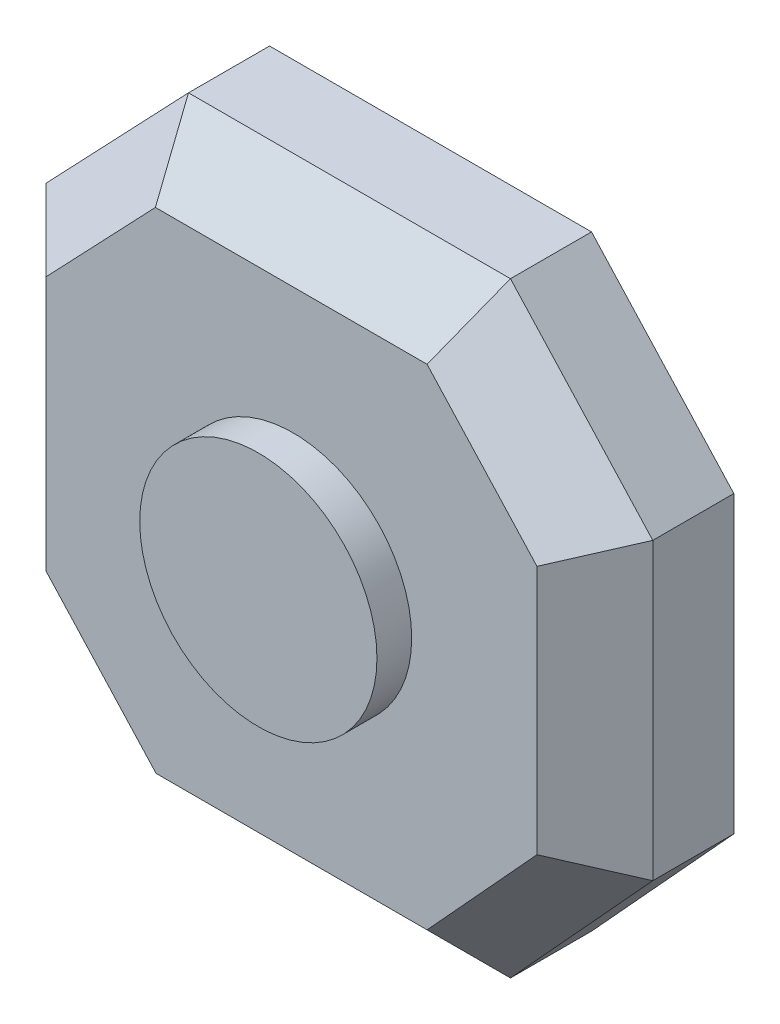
from build123d import *

# Parameters (mm, degrees)
AUFSATZ_LINEAR_AUSTRAGEN1_DEPTH = 1.2
FASE1_SIZE                      = 0.5
SKIZZE2_R                       = 1.024181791
AUFSATZ_LINEAR_AUSTRAGEN2_DEPTH = 1.5


with BuildPart() as part:
    # Skizze1 → Aufsatz-Linear austragen1 (new body)
    with BuildSketch(Plane.XY):
        Polygon((-1.403270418, 2.614789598), (1.377122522, 2.614789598), (2.606073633, 1.272530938), (2.606073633, -1.272530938), (1.377122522, -2.614789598), (-1.403270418, -2.614789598), (-2.632221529, -1.272530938), (-2.632221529, 1.32482673), align=None)
    extrude(amount=AUFSATZ_LINEAR_AUSTRAGEN1_DEPTH)

    # Fase1
    fase1_edges = [part.edges().sort_by_distance(p)[0] for p in [
        (-2.017745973, -1.943660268, 1.2),
        (-0.013073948, -2.614789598, 1.2),
        (1.991598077, -1.943660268, 1.2),
        (2.606073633, 0, 1.2),
        (1.991598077, 1.943660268, 1.2),
        (-0.013073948, 2.614789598, 1.2),
        (-2.017745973, 1.969808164, 1.2),
        (-2.632221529, 0.026147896, 1.2),
    ]]
    chamfer(fase1_edges, length=FASE1_SIZE)

    # Skizze2 → Aufsatz-Linear austragen2 (add)
    with BuildSketch(Plane.XY):
        with Locations(Location((0, 0, 0), (0, 0, 180))):
            Circle(SKIZZE2_R)
    extrude(amount=AUFSATZ_LINEAR_AUSTRAGEN2_DEPTH)


solid = part.part
